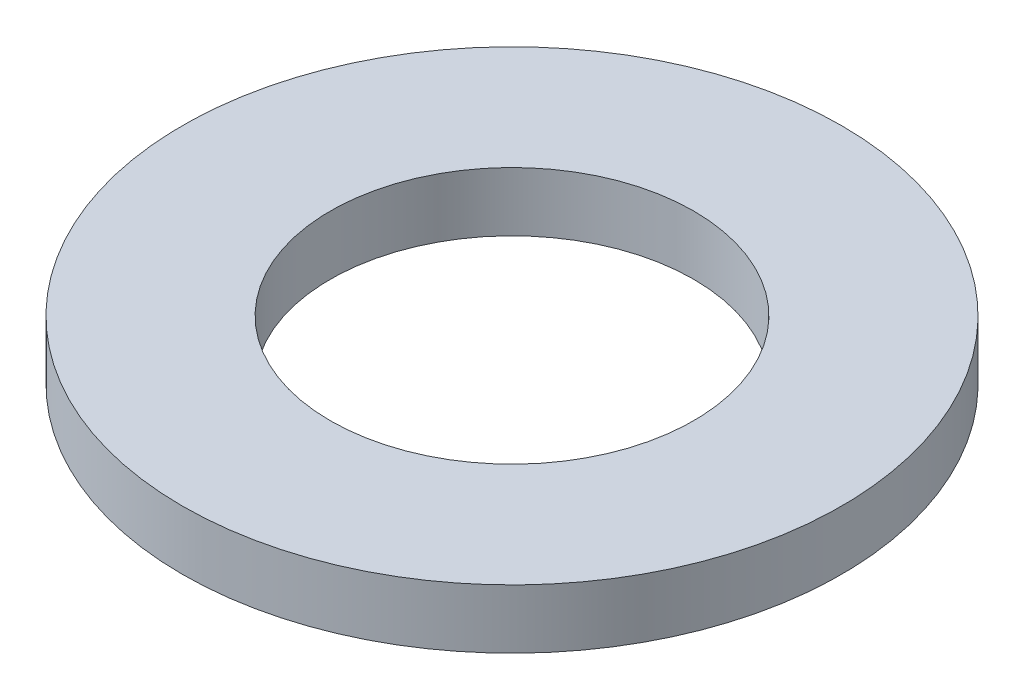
from build123d import *

# Parameters (mm, degrees)
SKETCH1_R      = 39
SKETCH1_R_2    = 21.5
EXTRUDE1_DEPTH = 7


with BuildPart() as part:
    # Sketch1 → Extrude1 (new body)
    with BuildSketch(Plane(origin=(0, 0, 0), x_dir=(1, 0, 0), z_dir=(0, 1, 0))):
        with Locations(Location((0, 0, 0), (0, 0, 270))):
            Circle(SKETCH1_R)
        with Locations(Location((0, 0, 0), (0, 0, 270))):
            Circle(SKETCH1_R_2, mode=Mode.SUBTRACT)
    extrude(amount=EXTRUDE1_DEPTH)


solid = part.part
